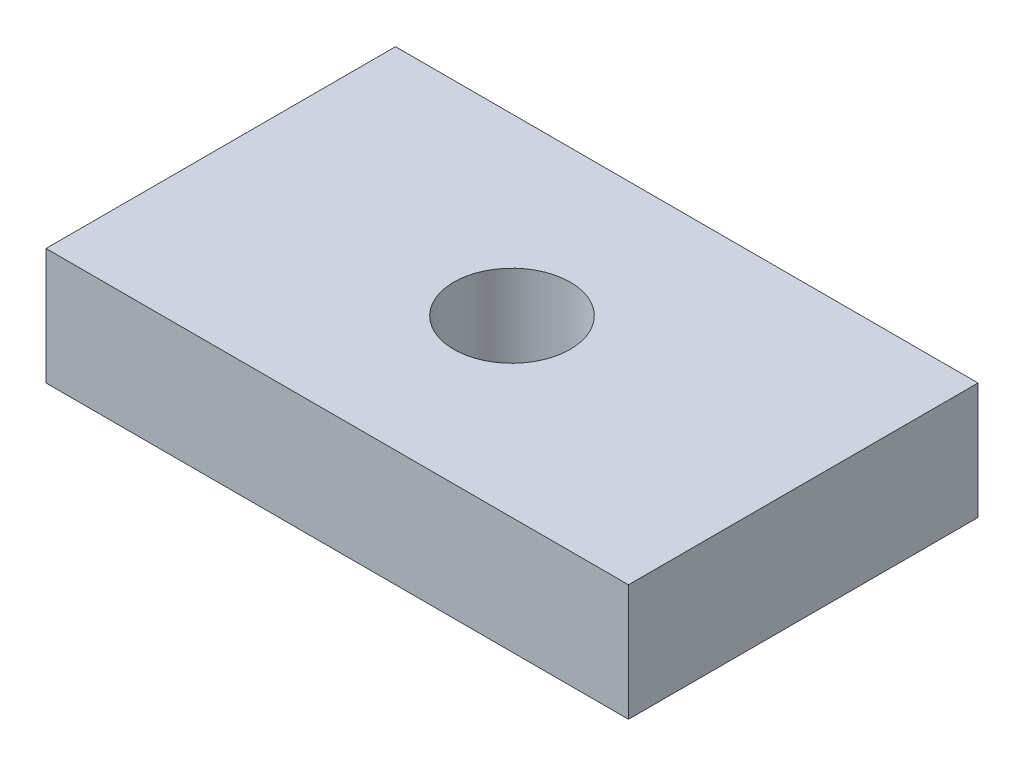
from build123d import *

# Parameters (mm, degrees)
SKETCH_1_W          = 100
SKETCH_1_H          = 60
EXTRUDE_1_DEPTH     = 20
SKETCH_2_R          = 10
CUT_EXTRUDE_1_DEPTH = 25


with BuildPart() as part:
    # Sketch 1 → Extrude 1 (new body)
    with BuildSketch(Plane(origin=(0, 0, 0), x_dir=(1, 0, 0), z_dir=(0, 1, 0))):
        Rectangle(SKETCH_1_W, SKETCH_1_H)
    extrude(amount=EXTRUDE_1_DEPTH)

    # Sketch 2 → Cut-Extrude 1 (cut)
    with BuildSketch(Plane(origin=(0, 0, 0), x_dir=(1, 0, 0), z_dir=(0, 1, 0))):
        with Locations(Location((0, 0, 0), (0, 0, 90))):
            Circle(SKETCH_2_R)
    extrude(amount=CUT_EXTRUDE_1_DEPTH, mode=Mode.SUBTRACT)


solid = part.part
